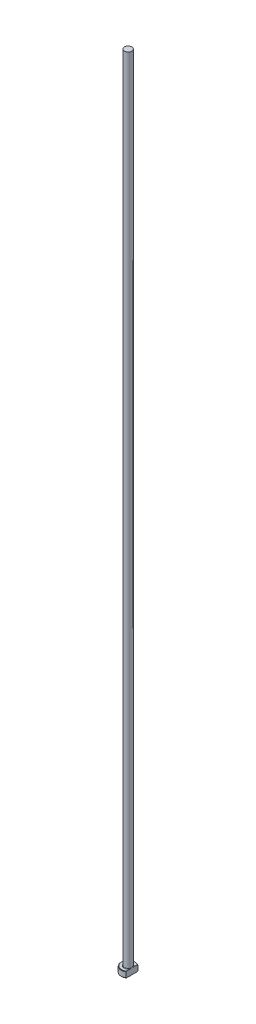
from build123d import *
from build123d.topology import SkipClean

# Parameters (mm, degrees)
CHAMFER1_SIZE = 0.2
FILLET1_R     = 0.2
KEY_DEPTH     = 401.030623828


with BuildPart() as part:
    # Sketch1 → Revolve1 (revolve)
    with BuildSketch(Plane.XY, mode=Mode.PRIVATE) as revolve1_sk:
        Polygon((0, 0), (-3.5, 0), (-3.5, 3), (-1.85, 3), (-1.85, 400), (0, 400), align=None)
    revolve(revolve1_sk.sketch.rotate(Axis((0, 259.958771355, 0), (0, -1, 0)), 270), axis=Axis((0, 259.958771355, 0), (0, -1, 0)))

    # Chamfer1
    chamfer1_edges = [part.edges().sort_by_distance(p)[0] for p in [
        (0, 3, -3.5),
        (0, 0, -3.5),
    ]]
    chamfer(chamfer1_edges, length=CHAMFER1_SIZE)

    # Fillet1
    fillet1_edges = [part.edges().sort_by_distance(p)[0] for p in [
        (0, 3, -1.85),
    ]]
    fillet(fillet1_edges, radius=FILLET1_R)

    # Sketch2 → KEY (cut, through all)
    with SkipClean():  # the faces are left unmerged after this step: merging them gives an invalid solid
        with BuildSketch(Plane(origin=(0, 0, 0), x_dir=(1, 0, 0), z_dir=(0, 1, 0))):
            with BuildLine():
                Line((1.85, 2.971110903), (1.85, -2.971110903))
                ThreePointArc((1.85, -2.971110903), (3.5, 0), (1.85, 2.971110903))
            make_face()
        extrude(amount=KEY_DEPTH, mode=Mode.SUBTRACT)


solid = part.part
